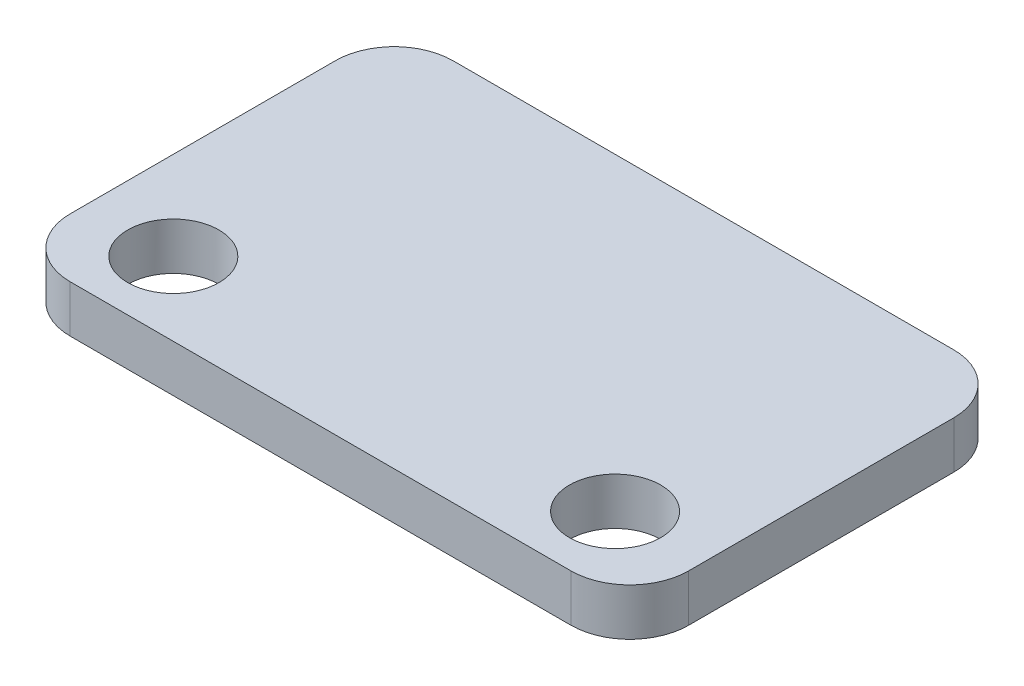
ISO-10303-21;
HEADER;
FILE_DESCRIPTION(('STEP AP214'),'2;1');
FILE_NAME('part.step','',(''),(''),'','','');
FILE_SCHEMA(('AUTOMOTIVE_DESIGN { 1 0 10303 214 1 1 1 1 }'));
ENDSEC;
DATA;
#1=APPLICATION_CONTEXT('core data for automotive mechanical design processes');
#2=APPLICATION_PROTOCOL_DEFINITION('international standard','automotive_design',2000,#1);
#3=PRODUCT_CONTEXT('',#1,'mechanical');
#4=PRODUCT('Part','Part','',(#3));
#5=PRODUCT_RELATED_PRODUCT_CATEGORY('part','',(#4));
#6=PRODUCT_DEFINITION_FORMATION('','',#4);
#7=PRODUCT_DEFINITION_CONTEXT('part definition',#1,'design');
#8=PRODUCT_DEFINITION('design','',#6,#7);
#9=PRODUCT_DEFINITION_SHAPE('','',#8);
#10=(LENGTH_UNIT() NAMED_UNIT(*) SI_UNIT(.MILLI.,.METRE.));
#11=(NAMED_UNIT(*) PLANE_ANGLE_UNIT() SI_UNIT($,.RADIAN.));
#12=(NAMED_UNIT(*) SI_UNIT($,.STERADIAN.) SOLID_ANGLE_UNIT());
#13=UNCERTAINTY_MEASURE_WITH_UNIT(LENGTH_MEASURE(1.E-05),#10,'distance_accuracy_value','');
#14=(GEOMETRIC_REPRESENTATION_CONTEXT(3) GLOBAL_UNCERTAINTY_ASSIGNED_CONTEXT((#13)) GLOBAL_UNIT_ASSIGNED_CONTEXT((#10,
#11,#12)) REPRESENTATION_CONTEXT('',''));
#15=CARTESIAN_POINT('',(0.,0.,0.));
#16=DIRECTION('',(0.,0.,1.));
#17=DIRECTION('',(1.,0.,0.));
#18=AXIS2_PLACEMENT_3D('',#15,#16,#17);
#19=CARTESIAN_POINT('',(8.5,1.6,-4.5));
#20=DIRECTION('',(0.,-1.,0.));
#21=DIRECTION('',(0.,0.,-1.));
#22=AXIS2_PLACEMENT_3D('',#19,#20,#21);
#23=CYLINDRICAL_SURFACE('',#22,2.);
#24=CARTESIAN_POINT('',(8.5,0.,-4.5));
#25=DIRECTION('',(0.,1.,0.));
#26=DIRECTION('',(0.,0.,-1.));
#27=AXIS2_PLACEMENT_3D('',#24,#25,#26);
#28=CIRCLE('',#27,2.);
#29=CARTESIAN_POINT('',(10.5,0.,-4.49999999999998));
#30=VERTEX_POINT('',#29);
#31=CARTESIAN_POINT('',(8.49999999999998,0.,-6.5));
#32=VERTEX_POINT('',#31);
#33=EDGE_CURVE('E135',#30,#32,#28,.T.);
#34=ORIENTED_EDGE('',*,*,#33,.T.);
#35=DIRECTION('',(0.,-1.,0.));
#36=VECTOR('',#35,1.);
#37=CARTESIAN_POINT('',(8.49999999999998,1.6,-6.5));
#38=LINE('',#37,#36);
#39=CARTESIAN_POINT('',(8.49999999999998,1.6,-6.5));
#40=VERTEX_POINT('',#39);
#41=EDGE_CURVE('E11',#40,#32,#38,.T.);
#42=ORIENTED_EDGE('',*,*,#41,.F.);
#43=CARTESIAN_POINT('',(8.5,1.6,-4.5));
#44=DIRECTION('',(0.,1.,0.));
#45=DIRECTION('',(0.,0.,-1.));
#46=AXIS2_PLACEMENT_3D('',#43,#44,#45);
#47=CIRCLE('',#46,2.);
#48=CARTESIAN_POINT('',(10.5,1.6,-4.49999999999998));
#49=VERTEX_POINT('',#48);
#50=EDGE_CURVE('E150',#49,#40,#47,.T.);
#51=ORIENTED_EDGE('',*,*,#50,.F.);
#52=DIRECTION('',(0.,-1.,0.));
#53=VECTOR('',#52,1.);
#54=CARTESIAN_POINT('',(10.5,1.6,-4.49999999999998));
#55=LINE('',#54,#53);
#56=EDGE_CURVE('E131',#49,#30,#55,.T.);
#57=ORIENTED_EDGE('',*,*,#56,.T.);
#58=EDGE_LOOP('',(#34,#42,#51,#57));
#59=FACE_BOUND('',#58,.T.);
#60=ADVANCED_FACE('F39',(#59),#23,.T.);
#61=CARTESIAN_POINT('',(-8.49999999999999,1.6,-6.5));
#62=DIRECTION('',(0.,0.,1.));
#63=DIRECTION('',(1.,0.,0.));
#64=AXIS2_PLACEMENT_3D('',#61,#62,#63);
#65=PLANE('',#64);
#66=DIRECTION('',(-1.,0.,0.));
#67=VECTOR('',#66,1.);
#68=CARTESIAN_POINT('',(-8.49999999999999,0.,-6.5));
#69=LINE('',#68,#67);
#70=CARTESIAN_POINT('',(-8.49999999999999,0.,-6.5));
#71=VERTEX_POINT('',#70);
#72=EDGE_CURVE('E138',#32,#71,#69,.T.);
#73=ORIENTED_EDGE('',*,*,#72,.T.);
#74=DIRECTION('',(0.,-1.,0.));
#75=VECTOR('',#74,1.);
#76=CARTESIAN_POINT('',(-8.49999999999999,1.6,-6.5));
#77=LINE('',#76,#75);
#78=CARTESIAN_POINT('',(-8.49999999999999,1.6,-6.5));
#79=VERTEX_POINT('',#78);
#80=EDGE_CURVE('E47',#79,#71,#77,.T.);
#81=ORIENTED_EDGE('',*,*,#80,.F.);
#82=DIRECTION('',(-1.,0.,0.));
#83=VECTOR('',#82,1.);
#84=CARTESIAN_POINT('',(-8.49999999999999,1.6,-6.5));
#85=LINE('',#84,#83);
#86=EDGE_CURVE('E98',#40,#79,#85,.T.);
#87=ORIENTED_EDGE('',*,*,#86,.F.);
#88=ORIENTED_EDGE('',*,*,#41,.T.);
#89=EDGE_LOOP('',(#73,#81,#87,#88));
#90=FACE_BOUND('',#89,.T.);
#91=ADVANCED_FACE('F217',(#90),#65,.F.);
#92=CARTESIAN_POINT('',(-8.5,1.6,-4.5));
#93=DIRECTION('',(0.,-1.,0.));
#94=DIRECTION('',(0.,0.,-1.));
#95=AXIS2_PLACEMENT_3D('',#92,#93,#94);
#96=CYLINDRICAL_SURFACE('',#95,2.);
#97=CARTESIAN_POINT('',(-8.5,0.,-4.5));
#98=DIRECTION('',(0.,1.,0.));
#99=DIRECTION('',(0.,0.,1.));
#100=AXIS2_PLACEMENT_3D('',#97,#98,#99);
#101=CIRCLE('',#100,2.);
#102=CARTESIAN_POINT('',(-10.5,0.,-4.49999999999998));
#103=VERTEX_POINT('',#102);
#104=EDGE_CURVE('E141',#71,#103,#101,.T.);
#105=ORIENTED_EDGE('',*,*,#104,.T.);
#106=DIRECTION('',(0.,-1.,0.));
#107=VECTOR('',#106,1.);
#108=CARTESIAN_POINT('',(-10.5,1.6,-4.49999999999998));
#109=LINE('',#108,#107);
#110=CARTESIAN_POINT('',(-10.5,1.6,-4.49999999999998));
#111=VERTEX_POINT('',#110);
#112=EDGE_CURVE('E157',#111,#103,#109,.T.);
#113=ORIENTED_EDGE('',*,*,#112,.F.);
#114=CARTESIAN_POINT('',(-8.5,1.6,-4.5));
#115=DIRECTION('',(0.,1.,0.));
#116=DIRECTION('',(0.,0.,1.));
#117=AXIS2_PLACEMENT_3D('',#114,#115,#116);
#118=CIRCLE('',#117,2.);
#119=EDGE_CURVE('E165',#79,#111,#118,.T.);
#120=ORIENTED_EDGE('',*,*,#119,.F.);
#121=ORIENTED_EDGE('',*,*,#80,.T.);
#122=EDGE_LOOP('',(#105,#113,#120,#121));
#123=FACE_BOUND('',#122,.T.);
#124=ADVANCED_FACE('F163',(#123),#96,.T.);
#125=CARTESIAN_POINT('',(-10.5,1.6,-4.49999999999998));
#126=DIRECTION('',(1.,0.,0.));
#127=DIRECTION('',(0.,0.,-1.));
#128=AXIS2_PLACEMENT_3D('',#125,#126,#127);
#129=PLANE('',#128);
#130=DIRECTION('',(0.,0.,1.));
#131=VECTOR('',#130,1.);
#132=CARTESIAN_POINT('',(-10.5,0.,-4.49999999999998));
#133=LINE('',#132,#131);
#134=CARTESIAN_POINT('',(-10.5,0.,4.49999999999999));
#135=VERTEX_POINT('',#134);
#136=EDGE_CURVE('E143',#103,#135,#133,.T.);
#137=ORIENTED_EDGE('',*,*,#136,.T.);
#138=DIRECTION('',(0.,-1.,0.));
#139=VECTOR('',#138,1.);
#140=CARTESIAN_POINT('',(-10.5,1.6,4.49999999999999));
#141=LINE('',#140,#139);
#142=CARTESIAN_POINT('',(-10.5,1.6,4.49999999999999));
#143=VERTEX_POINT('',#142);
#144=EDGE_CURVE('E154',#143,#135,#141,.T.);
#145=ORIENTED_EDGE('',*,*,#144,.F.);
#146=DIRECTION('',(0.,0.,1.));
#147=VECTOR('',#146,1.);
#148=CARTESIAN_POINT('',(-10.5,1.6,-4.49999999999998));
#149=LINE('',#148,#147);
#150=EDGE_CURVE('E177',#111,#143,#149,.T.);
#151=ORIENTED_EDGE('',*,*,#150,.F.);
#152=ORIENTED_EDGE('',*,*,#112,.T.);
#153=EDGE_LOOP('',(#137,#145,#151,#152));
#154=FACE_BOUND('',#153,.T.);
#155=ADVANCED_FACE('F173',(#154),#129,.F.);
#156=CARTESIAN_POINT('',(-8.5,1.6,4.5));
#157=DIRECTION('',(0.,-1.,0.));
#158=DIRECTION('',(0.,0.,-1.));
#159=AXIS2_PLACEMENT_3D('',#156,#157,#158);
#160=CYLINDRICAL_SURFACE('',#159,2.);
#161=CARTESIAN_POINT('',(-8.5,0.,4.5));
#162=DIRECTION('',(0.,1.,0.));
#163=DIRECTION('',(0.,0.,1.));
#164=AXIS2_PLACEMENT_3D('',#161,#162,#163);
#165=CIRCLE('',#164,2.);
#166=CARTESIAN_POINT('',(-8.5,0.,6.5));
#167=VERTEX_POINT('',#166);
#168=EDGE_CURVE('E145',#135,#167,#165,.T.);
#169=ORIENTED_EDGE('',*,*,#168,.T.);
#170=DIRECTION('',(0.,-1.,0.));
#171=VECTOR('',#170,1.);
#172=CARTESIAN_POINT('',(-8.5,1.6,6.5));
#173=LINE('',#172,#171);
#174=CARTESIAN_POINT('',(-8.5,1.6,6.5));
#175=VERTEX_POINT('',#174);
#176=EDGE_CURVE('E126',#175,#167,#173,.T.);
#177=ORIENTED_EDGE('',*,*,#176,.F.);
#178=CARTESIAN_POINT('',(-8.5,1.6,4.5));
#179=DIRECTION('',(0.,1.,0.));
#180=DIRECTION('',(0.,0.,1.));
#181=AXIS2_PLACEMENT_3D('',#178,#179,#180);
#182=CIRCLE('',#181,2.);
#183=EDGE_CURVE('E117',#143,#175,#182,.T.);
#184=ORIENTED_EDGE('',*,*,#183,.F.);
#185=ORIENTED_EDGE('',*,*,#144,.T.);
#186=EDGE_LOOP('',(#169,#177,#184,#185));
#187=FACE_BOUND('',#186,.T.);
#188=ADVANCED_FACE('F176',(#187),#160,.T.);
#189=CARTESIAN_POINT('',(-8.49999999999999,1.6,6.5));
#190=DIRECTION('',(0.,0.,-1.));
#191=DIRECTION('',(-1.,0.,0.));
#192=AXIS2_PLACEMENT_3D('',#189,#190,#191);
#193=PLANE('',#192);
#194=DIRECTION('',(1.,0.,0.));
#195=VECTOR('',#194,1.);
#196=CARTESIAN_POINT('',(-8.49999999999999,0.,6.5));
#197=LINE('',#196,#195);
#198=CARTESIAN_POINT('',(8.49999999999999,0.,6.5));
#199=VERTEX_POINT('',#198);
#200=EDGE_CURVE('E125',#167,#199,#197,.T.);
#201=ORIENTED_EDGE('',*,*,#200,.T.);
#202=DIRECTION('',(0.,-1.,0.));
#203=VECTOR('',#202,1.);
#204=CARTESIAN_POINT('',(8.49999999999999,1.6,6.5));
#205=LINE('',#204,#203);
#206=CARTESIAN_POINT('',(8.49999999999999,1.6,6.5));
#207=VERTEX_POINT('',#206);
#208=EDGE_CURVE('E122',#207,#199,#205,.T.);
#209=ORIENTED_EDGE('',*,*,#208,.F.);
#210=DIRECTION('',(1.,0.,0.));
#211=VECTOR('',#210,1.);
#212=CARTESIAN_POINT('',(-8.49999999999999,1.6,6.5));
#213=LINE('',#212,#211);
#214=EDGE_CURVE('E111',#175,#207,#213,.T.);
#215=ORIENTED_EDGE('',*,*,#214,.F.);
#216=ORIENTED_EDGE('',*,*,#176,.T.);
#217=EDGE_LOOP('',(#201,#209,#215,#216));
#218=FACE_BOUND('',#217,.T.);
#219=ADVANCED_FACE('F123',(#218),#193,.F.);
#220=CARTESIAN_POINT('',(8.5,1.6,4.5));
#221=DIRECTION('',(0.,-1.,0.));
#222=DIRECTION('',(0.,0.,-1.));
#223=AXIS2_PLACEMENT_3D('',#220,#221,#222);
#224=CYLINDRICAL_SURFACE('',#223,2.);
#225=CARTESIAN_POINT('',(8.5,0.,4.5));
#226=DIRECTION('',(0.,1.,0.));
#227=DIRECTION('',(0.,0.,1.));
#228=AXIS2_PLACEMENT_3D('',#225,#226,#227);
#229=CIRCLE('',#228,2.);
#230=CARTESIAN_POINT('',(10.5,0.,4.49999999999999));
#231=VERTEX_POINT('',#230);
#232=EDGE_CURVE('E84',#199,#231,#229,.T.);
#233=ORIENTED_EDGE('',*,*,#232,.T.);
#234=DIRECTION('',(0.,-1.,0.));
#235=VECTOR('',#234,1.);
#236=CARTESIAN_POINT('',(10.5,1.6,4.49999999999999));
#237=LINE('',#236,#235);
#238=CARTESIAN_POINT('',(10.5,1.6,4.49999999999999));
#239=VERTEX_POINT('',#238);
#240=EDGE_CURVE('E127',#239,#231,#237,.T.);
#241=ORIENTED_EDGE('',*,*,#240,.F.);
#242=CARTESIAN_POINT('',(8.5,1.6,4.5));
#243=DIRECTION('',(0.,1.,0.));
#244=DIRECTION('',(0.,0.,1.));
#245=AXIS2_PLACEMENT_3D('',#242,#243,#244);
#246=CIRCLE('',#245,2.);
#247=EDGE_CURVE('E115',#207,#239,#246,.T.);
#248=ORIENTED_EDGE('',*,*,#247,.F.);
#249=ORIENTED_EDGE('',*,*,#208,.T.);
#250=EDGE_LOOP('',(#233,#241,#248,#249));
#251=FACE_BOUND('',#250,.T.);
#252=ADVANCED_FACE('F129',(#251),#224,.T.);
#253=CARTESIAN_POINT('',(10.5,1.6,-4.49999999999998));
#254=DIRECTION('',(-1.,0.,0.));
#255=DIRECTION('',(0.,0.,1.));
#256=AXIS2_PLACEMENT_3D('',#253,#254,#255);
#257=PLANE('',#256);
#258=DIRECTION('',(0.,0.,-1.));
#259=VECTOR('',#258,1.);
#260=CARTESIAN_POINT('',(10.5,0.,-4.49999999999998));
#261=LINE('',#260,#259);
#262=EDGE_CURVE('E90',#231,#30,#261,.T.);
#263=ORIENTED_EDGE('',*,*,#262,.T.);
#264=ORIENTED_EDGE('',*,*,#56,.F.);
#265=DIRECTION('',(0.,0.,-1.));
#266=VECTOR('',#265,1.);
#267=CARTESIAN_POINT('',(10.5,1.6,-4.49999999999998));
#268=LINE('',#267,#266);
#269=EDGE_CURVE('E55',#239,#49,#268,.T.);
#270=ORIENTED_EDGE('',*,*,#269,.F.);
#271=ORIENTED_EDGE('',*,*,#240,.T.);
#272=EDGE_LOOP('',(#263,#264,#270,#271));
#273=FACE_BOUND('',#272,.T.);
#274=ADVANCED_FACE('F199',(#273),#257,.F.);
#275=CARTESIAN_POINT('',(8.5,1.6,-4.5));
#276=DIRECTION('',(0.,-1.,0.));
#277=DIRECTION('',(0.,0.,-1.));
#278=AXIS2_PLACEMENT_3D('',#275,#276,#277);
#279=PLANE('',#278);
#280=CARTESIAN_POINT('',(-7.5,1.6,4.));
#281=DIRECTION('',(0.,1.,0.));
#282=DIRECTION('',(0.,0.,1.));
#283=AXIS2_PLACEMENT_3D('',#280,#281,#282);
#284=CIRCLE('',#283,1.55);
#285=CARTESIAN_POINT('',(-7.5,1.6,5.55));
#286=VERTEX_POINT('',#285);
#287=EDGE_CURVE('E139',#286,#286,#284,.T.);
#288=ORIENTED_EDGE('',*,*,#287,.F.);
#289=EDGE_LOOP('',(#288));
#290=FACE_BOUND('',#289,.T.);
#291=CARTESIAN_POINT('',(7.5,1.6,4.));
#292=DIRECTION('',(0.,1.,0.));
#293=DIRECTION('',(0.,0.,-1.));
#294=AXIS2_PLACEMENT_3D('',#291,#292,#293);
#295=CIRCLE('',#294,1.55);
#296=CARTESIAN_POINT('',(7.5,1.6,2.45));
#297=VERTEX_POINT('',#296);
#298=EDGE_CURVE('E183',#297,#297,#295,.T.);
#299=ORIENTED_EDGE('',*,*,#298,.F.);
#300=EDGE_LOOP('',(#299));
#301=FACE_BOUND('',#300,.T.);
#302=ORIENTED_EDGE('',*,*,#50,.T.);
#303=ORIENTED_EDGE('',*,*,#86,.T.);
#304=ORIENTED_EDGE('',*,*,#119,.T.);
#305=ORIENTED_EDGE('',*,*,#150,.T.);
#306=ORIENTED_EDGE('',*,*,#183,.T.);
#307=ORIENTED_EDGE('',*,*,#214,.T.);
#308=ORIENTED_EDGE('',*,*,#247,.T.);
#309=ORIENTED_EDGE('',*,*,#269,.T.);
#310=EDGE_LOOP('',(#302,#303,#304,#305,#306,#307,#308,#309));
#311=FACE_BOUND('',#310,.T.);
#312=ADVANCED_FACE('F113',(#290,#301,#311),#279,.F.);
#313=CARTESIAN_POINT('',(8.5,0.,-4.5));
#314=DIRECTION('',(0.,-1.,0.));
#315=DIRECTION('',(0.,0.,-1.));
#316=AXIS2_PLACEMENT_3D('',#313,#314,#315);
#317=PLANE('',#316);
#318=CARTESIAN_POINT('',(-7.5,0.,4.));
#319=DIRECTION('',(0.,-1.,0.));
#320=DIRECTION('',(0.,0.,-1.));
#321=AXIS2_PLACEMENT_3D('',#318,#319,#320);
#322=CIRCLE('',#321,1.55);
#323=CARTESIAN_POINT('',(-7.5,0.,2.45));
#324=VERTEX_POINT('',#323);
#325=EDGE_CURVE('E189',#324,#324,#322,.F.);
#326=ORIENTED_EDGE('',*,*,#325,.T.);
#327=EDGE_LOOP('',(#326));
#328=FACE_BOUND('',#327,.T.);
#329=CARTESIAN_POINT('',(7.5,0.,4.));
#330=DIRECTION('',(0.,-1.,0.));
#331=DIRECTION('',(0.,0.,-1.));
#332=AXIS2_PLACEMENT_3D('',#329,#330,#331);
#333=CIRCLE('',#332,1.55);
#334=CARTESIAN_POINT('',(7.5,0.,2.45));
#335=VERTEX_POINT('',#334);
#336=EDGE_CURVE('E186',#335,#335,#333,.F.);
#337=ORIENTED_EDGE('',*,*,#336,.T.);
#338=EDGE_LOOP('',(#337));
#339=FACE_BOUND('',#338,.T.);
#340=ORIENTED_EDGE('',*,*,#33,.F.);
#341=ORIENTED_EDGE('',*,*,#262,.F.);
#342=ORIENTED_EDGE('',*,*,#232,.F.);
#343=ORIENTED_EDGE('',*,*,#200,.F.);
#344=ORIENTED_EDGE('',*,*,#168,.F.);
#345=ORIENTED_EDGE('',*,*,#136,.F.);
#346=ORIENTED_EDGE('',*,*,#104,.F.);
#347=ORIENTED_EDGE('',*,*,#72,.F.);
#348=EDGE_LOOP('',(#340,#341,#342,#343,#344,#345,#346,#347));
#349=FACE_BOUND('',#348,.T.);
#350=ADVANCED_FACE('F169',(#328,#339,#349),#317,.T.);
#351=CARTESIAN_POINT('',(7.5,-0.000999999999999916,4.));
#352=DIRECTION('',(0.,1.,0.));
#353=DIRECTION('',(0.,0.,1.));
#354=AXIS2_PLACEMENT_3D('',#351,#352,#353);
#355=CYLINDRICAL_SURFACE('',#354,1.55);
#356=ORIENTED_EDGE('',*,*,#336,.F.);
#357=EDGE_LOOP('',(#356));
#358=FACE_BOUND('',#357,.T.);
#359=ORIENTED_EDGE('',*,*,#298,.T.);
#360=EDGE_LOOP('',(#359));
#361=FACE_BOUND('',#360,.T.);
#362=ADVANCED_FACE('F203',(#358,#361),#355,.F.);
#363=CARTESIAN_POINT('',(-7.5,-0.000999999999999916,4.));
#364=DIRECTION('',(0.,1.,0.));
#365=DIRECTION('',(0.,0.,1.));
#366=AXIS2_PLACEMENT_3D('',#363,#364,#365);
#367=CYLINDRICAL_SURFACE('',#366,1.55);
#368=ORIENTED_EDGE('',*,*,#325,.F.);
#369=EDGE_LOOP('',(#368));
#370=FACE_BOUND('',#369,.T.);
#371=ORIENTED_EDGE('',*,*,#287,.T.);
#372=EDGE_LOOP('',(#371));
#373=FACE_BOUND('',#372,.T.);
#374=ADVANCED_FACE('F195',(#370,#373),#367,.F.);
#375=CLOSED_SHELL('',(#60,#91,#124,#155,#188,#219,#252,#274,#312,#350,#362,#374));
#376=MANIFOLD_SOLID_BREP('B2',#375);
#377=ADVANCED_BREP_SHAPE_REPRESENTATION('',(#18,#376),#14);
#378=SHAPE_DEFINITION_REPRESENTATION(#9,#377);
ENDSEC;
END-ISO-10303-21;
